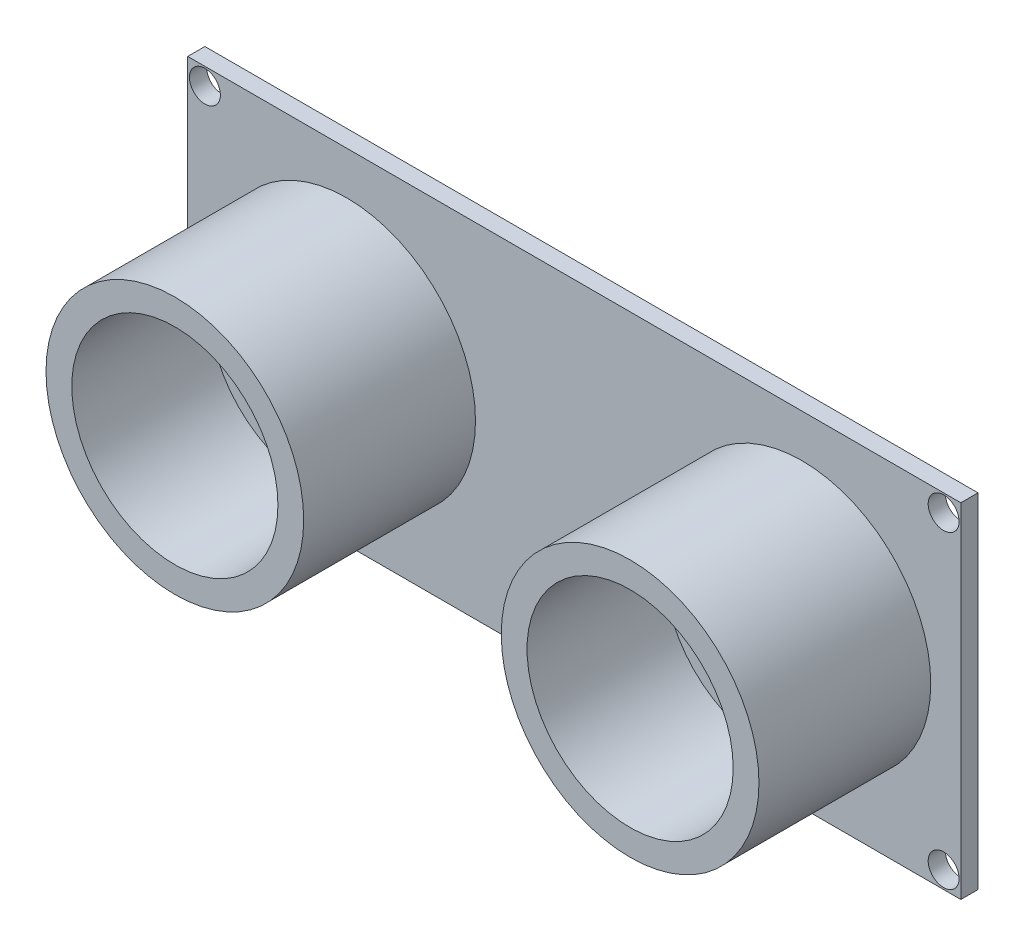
ISO-10303-21;
HEADER;
FILE_DESCRIPTION(('STEP AP214'),'2;1');
FILE_NAME('part.step','',(''),(''),'','','');
FILE_SCHEMA(('AUTOMOTIVE_DESIGN { 1 0 10303 214 1 1 1 1 }'));
ENDSEC;
DATA;
#1=APPLICATION_CONTEXT('core data for automotive mechanical design processes');
#2=APPLICATION_PROTOCOL_DEFINITION('international standard','automotive_design',2000,#1);
#3=PRODUCT_CONTEXT('',#1,'mechanical');
#4=PRODUCT('Part','Part','',(#3));
#5=PRODUCT_RELATED_PRODUCT_CATEGORY('part','',(#4));
#6=PRODUCT_DEFINITION_FORMATION('','',#4);
#7=PRODUCT_DEFINITION_CONTEXT('part definition',#1,'design');
#8=PRODUCT_DEFINITION('design','',#6,#7);
#9=PRODUCT_DEFINITION_SHAPE('','',#8);
#10=(LENGTH_UNIT() NAMED_UNIT(*) SI_UNIT(.MILLI.,.METRE.));
#11=(NAMED_UNIT(*) PLANE_ANGLE_UNIT() SI_UNIT($,.RADIAN.));
#12=(NAMED_UNIT(*) SI_UNIT($,.STERADIAN.) SOLID_ANGLE_UNIT());
#13=UNCERTAINTY_MEASURE_WITH_UNIT(LENGTH_MEASURE(1.E-05),#10,'distance_accuracy_value','');
#14=(GEOMETRIC_REPRESENTATION_CONTEXT(3) GLOBAL_UNCERTAINTY_ASSIGNED_CONTEXT((#13)) GLOBAL_UNIT_ASSIGNED_CONTEXT((#10,
#11,#12)) REPRESENTATION_CONTEXT('',''));
#15=CARTESIAN_POINT('',(0.,0.,0.));
#16=DIRECTION('',(0.,0.,1.));
#17=DIRECTION('',(1.,0.,0.));
#18=AXIS2_PLACEMENT_3D('',#15,#16,#17);
#19=CARTESIAN_POINT('',(0.,0.,0.));
#20=DIRECTION('',(0.,0.,1.));
#21=DIRECTION('',(1.,0.,0.));
#22=AXIS2_PLACEMENT_3D('',#19,#20,#21);
#23=PLANE('',#22);
#24=CARTESIAN_POINT('',(-21.5,9.,0.));
#25=DIRECTION('',(0.,0.,1.));
#26=DIRECTION('',(1.,0.,0.));
#27=AXIS2_PLACEMENT_3D('',#24,#25,#26);
#28=CIRCLE('',#27,0.899999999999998);
#29=CARTESIAN_POINT('',(-20.6,9.,0.));
#30=VERTEX_POINT('',#29);
#31=EDGE_CURVE('E362',#30,#30,#28,.T.);
#32=ORIENTED_EDGE('',*,*,#31,.T.);
#33=EDGE_LOOP('',(#32));
#34=FACE_BOUND('',#33,.T.);
#35=CARTESIAN_POINT('',(21.5,9.,0.));
#36=DIRECTION('',(0.,0.,1.));
#37=DIRECTION('',(1.,0.,0.));
#38=AXIS2_PLACEMENT_3D('',#35,#36,#37);
#39=CIRCLE('',#38,0.899999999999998);
#40=CARTESIAN_POINT('',(22.4,9.,0.));
#41=VERTEX_POINT('',#40);
#42=EDGE_CURVE('E368',#41,#41,#39,.T.);
#43=ORIENTED_EDGE('',*,*,#42,.T.);
#44=EDGE_LOOP('',(#43));
#45=FACE_BOUND('',#44,.T.);
#46=CARTESIAN_POINT('',(-21.5,-9.,0.));
#47=DIRECTION('',(0.,0.,1.));
#48=DIRECTION('',(1.,0.,0.));
#49=AXIS2_PLACEMENT_3D('',#46,#47,#48);
#50=CIRCLE('',#49,0.899999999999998);
#51=CARTESIAN_POINT('',(-20.6,-9.,0.));
#52=VERTEX_POINT('',#51);
#53=EDGE_CURVE('E374',#52,#52,#50,.T.);
#54=ORIENTED_EDGE('',*,*,#53,.T.);
#55=EDGE_LOOP('',(#54));
#56=FACE_BOUND('',#55,.T.);
#57=CARTESIAN_POINT('',(21.5,-9.,0.));
#58=DIRECTION('',(0.,0.,1.));
#59=DIRECTION('',(1.,0.,0.));
#60=AXIS2_PLACEMENT_3D('',#57,#58,#59);
#61=CIRCLE('',#60,0.899999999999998);
#62=CARTESIAN_POINT('',(22.4,-9.,0.));
#63=VERTEX_POINT('',#62);
#64=EDGE_CURVE('E380',#63,#63,#61,.T.);
#65=ORIENTED_EDGE('',*,*,#64,.T.);
#66=EDGE_LOOP('',(#65));
#67=FACE_BOUND('',#66,.T.);
#68=DIRECTION('',(0.,1.,0.));
#69=VECTOR('',#68,1.);
#70=CARTESIAN_POINT('',(-2.5,-8.,0.));
#71=LINE('',#70,#69);
#72=CARTESIAN_POINT('',(-2.5,-10.,0.));
#73=VERTEX_POINT('',#72);
#74=CARTESIAN_POINT('',(-2.5,-8.,0.));
#75=VERTEX_POINT('',#74);
#76=EDGE_CURVE('E231',#73,#75,#71,.T.);
#77=ORIENTED_EDGE('',*,*,#76,.F.);
#78=DIRECTION('',(1.,0.,0.));
#79=VECTOR('',#78,1.);
#80=CARTESIAN_POINT('',(-22.5,-10.,0.));
#81=LINE('',#80,#79);
#82=CARTESIAN_POINT('',(-22.5,-10.,0.));
#83=VERTEX_POINT('',#82);
#84=EDGE_CURVE('E388',#83,#73,#81,.T.);
#85=ORIENTED_EDGE('',*,*,#84,.F.);
#86=DIRECTION('',(0.,-1.,0.));
#87=VECTOR('',#86,1.);
#88=CARTESIAN_POINT('',(-22.5,10.,0.));
#89=LINE('',#88,#87);
#90=CARTESIAN_POINT('',(-22.5,10.,0.));
#91=VERTEX_POINT('',#90);
#92=EDGE_CURVE('E399',#91,#83,#89,.T.);
#93=ORIENTED_EDGE('',*,*,#92,.F.);
#94=DIRECTION('',(-1.,0.,0.));
#95=VECTOR('',#94,1.);
#96=CARTESIAN_POINT('',(-22.5,10.,0.));
#97=LINE('',#96,#95);
#98=CARTESIAN_POINT('',(22.5,10.,0.));
#99=VERTEX_POINT('',#98);
#100=EDGE_CURVE('E397',#99,#91,#97,.T.);
#101=ORIENTED_EDGE('',*,*,#100,.F.);
#102=DIRECTION('',(0.,1.,0.));
#103=VECTOR('',#102,1.);
#104=CARTESIAN_POINT('',(22.5,10.,0.));
#105=LINE('',#104,#103);
#106=CARTESIAN_POINT('',(22.5,-10.,0.));
#107=VERTEX_POINT('',#106);
#108=EDGE_CURVE('E383',#107,#99,#105,.T.);
#109=ORIENTED_EDGE('',*,*,#108,.F.);
#110=CARTESIAN_POINT('',(2.49999999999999,-10.,0.));
#111=VERTEX_POINT('',#110);
#112=EDGE_CURVE('E401',#111,#107,#81,.T.);
#113=ORIENTED_EDGE('',*,*,#112,.F.);
#114=DIRECTION('',(0.,-1.,0.));
#115=VECTOR('',#114,1.);
#116=CARTESIAN_POINT('',(2.5,-8.,0.));
#117=LINE('',#116,#115);
#118=CARTESIAN_POINT('',(2.5,-8.,0.));
#119=VERTEX_POINT('',#118);
#120=EDGE_CURVE('E316',#119,#111,#117,.T.);
#121=ORIENTED_EDGE('',*,*,#120,.F.);
#122=DIRECTION('',(1.,0.,0.));
#123=VECTOR('',#122,1.);
#124=CARTESIAN_POINT('',(2.5,-8.,0.));
#125=LINE('',#124,#123);
#126=CARTESIAN_POINT('',(2.,-8.,0.));
#127=VERTEX_POINT('',#126);
#128=EDGE_CURVE('E309',#127,#119,#125,.T.);
#129=ORIENTED_EDGE('',*,*,#128,.F.);
#130=DIRECTION('',(0.,1.,0.));
#131=VECTOR('',#130,1.);
#132=CARTESIAN_POINT('',(2.,-8.,0.));
#133=LINE('',#132,#131);
#134=CARTESIAN_POINT('',(1.99999999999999,-10.,0.));
#135=VERTEX_POINT('',#134);
#136=EDGE_CURVE('E11',#135,#127,#133,.T.);
#137=ORIENTED_EDGE('',*,*,#136,.F.);
#138=CARTESIAN_POINT('',(0.999999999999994,-10.,0.));
#139=VERTEX_POINT('',#138);
#140=EDGE_CURVE('E945',#139,#135,#81,.T.);
#141=ORIENTED_EDGE('',*,*,#140,.F.);
#142=DIRECTION('',(0.,-1.,0.));
#143=VECTOR('',#142,1.);
#144=CARTESIAN_POINT('',(1.,-8.,0.));
#145=LINE('',#144,#143);
#146=CARTESIAN_POINT('',(1.,-8.,0.));
#147=VERTEX_POINT('',#146);
#148=EDGE_CURVE('E291',#147,#139,#145,.T.);
#149=ORIENTED_EDGE('',*,*,#148,.F.);
#150=DIRECTION('',(1.,0.,0.));
#151=VECTOR('',#150,1.);
#152=CARTESIAN_POINT('',(1.,-8.,0.));
#153=LINE('',#152,#151);
#154=CARTESIAN_POINT('',(0.500000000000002,-8.,0.));
#155=VERTEX_POINT('',#154);
#156=EDGE_CURVE('E293',#155,#147,#153,.T.);
#157=ORIENTED_EDGE('',*,*,#156,.F.);
#158=DIRECTION('',(0.,1.,0.));
#159=VECTOR('',#158,1.);
#160=CARTESIAN_POINT('',(0.500000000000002,-8.,0.));
#161=LINE('',#160,#159);
#162=CARTESIAN_POINT('',(0.500000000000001,-10.,0.));
#163=VERTEX_POINT('',#162);
#164=EDGE_CURVE('E288',#163,#155,#161,.T.);
#165=ORIENTED_EDGE('',*,*,#164,.F.);
#166=CARTESIAN_POINT('',(-0.500000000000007,-10.,0.));
#167=VERTEX_POINT('',#166);
#168=EDGE_CURVE('E940',#167,#163,#81,.T.);
#169=ORIENTED_EDGE('',*,*,#168,.F.);
#170=DIRECTION('',(0.,-1.,0.));
#171=VECTOR('',#170,1.);
#172=CARTESIAN_POINT('',(-0.500000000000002,-8.,0.));
#173=LINE('',#172,#171);
#174=CARTESIAN_POINT('',(-0.500000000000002,-8.,0.));
#175=VERTEX_POINT('',#174);
#176=EDGE_CURVE('E64',#175,#167,#173,.T.);
#177=ORIENTED_EDGE('',*,*,#176,.F.);
#178=DIRECTION('',(1.,0.,0.));
#179=VECTOR('',#178,1.);
#180=CARTESIAN_POINT('',(-1.,-8.,0.));
#181=LINE('',#180,#179);
#182=CARTESIAN_POINT('',(-1.,-8.,0.));
#183=VERTEX_POINT('',#182);
#184=EDGE_CURVE('E259',#183,#175,#181,.T.);
#185=ORIENTED_EDGE('',*,*,#184,.F.);
#186=DIRECTION('',(0.,1.,0.));
#187=VECTOR('',#186,1.);
#188=CARTESIAN_POINT('',(-1.,-8.,0.));
#189=LINE('',#188,#187);
#190=CARTESIAN_POINT('',(-1.,-10.,0.));
#191=VERTEX_POINT('',#190);
#192=EDGE_CURVE('E261',#191,#183,#189,.T.);
#193=ORIENTED_EDGE('',*,*,#192,.F.);
#194=CARTESIAN_POINT('',(-2.00000000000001,-10.,0.));
#195=VERTEX_POINT('',#194);
#196=EDGE_CURVE('E404',#195,#191,#81,.T.);
#197=ORIENTED_EDGE('',*,*,#196,.F.);
#198=DIRECTION('',(0.,-1.,0.));
#199=VECTOR('',#198,1.);
#200=CARTESIAN_POINT('',(-2.,-8.,0.));
#201=LINE('',#200,#199);
#202=CARTESIAN_POINT('',(-2.,-8.,0.));
#203=VERTEX_POINT('',#202);
#204=EDGE_CURVE('E56',#203,#195,#201,.T.);
#205=ORIENTED_EDGE('',*,*,#204,.F.);
#206=DIRECTION('',(1.,0.,0.));
#207=VECTOR('',#206,1.);
#208=CARTESIAN_POINT('',(-2.5,-8.,0.));
#209=LINE('',#208,#207);
#210=EDGE_CURVE('E236',#75,#203,#209,.T.);
#211=ORIENTED_EDGE('',*,*,#210,.F.);
#212=EDGE_LOOP('',(#77,#85,#93,#101,#109,#113,#121,#129,#137,#141,#149,#157,#165,#169,#177,#185,
#193,#197,#205,#211));
#213=FACE_BOUND('',#212,.T.);
#214=ADVANCED_FACE('F39',(#34,#45,#56,#67,#213),#23,.F.);
#215=CARTESIAN_POINT('',(22.5,10.,1.));
#216=DIRECTION('',(-1.,0.,0.));
#217=DIRECTION('',(0.,-1.,0.));
#218=AXIS2_PLACEMENT_3D('',#215,#216,#217);
#219=PLANE('',#218);
#220=ORIENTED_EDGE('',*,*,#108,.T.);
#221=DIRECTION('',(0.,0.,-1.));
#222=VECTOR('',#221,1.);
#223=CARTESIAN_POINT('',(22.5,10.,1.));
#224=LINE('',#223,#222);
#225=CARTESIAN_POINT('',(22.5,10.,1.));
#226=VERTEX_POINT('',#225);
#227=EDGE_CURVE('E43',#226,#99,#224,.T.);
#228=ORIENTED_EDGE('',*,*,#227,.F.);
#229=DIRECTION('',(0.,1.,0.));
#230=VECTOR('',#229,1.);
#231=CARTESIAN_POINT('',(22.5,10.,1.));
#232=LINE('',#231,#230);
#233=CARTESIAN_POINT('',(22.5,-10.,1.));
#234=VERTEX_POINT('',#233);
#235=EDGE_CURVE('E384',#234,#226,#232,.T.);
#236=ORIENTED_EDGE('',*,*,#235,.F.);
#237=DIRECTION('',(0.,0.,-1.));
#238=VECTOR('',#237,1.);
#239=CARTESIAN_POINT('',(22.5,-10.,1.));
#240=LINE('',#239,#238);
#241=EDGE_CURVE('E394',#234,#107,#240,.T.);
#242=ORIENTED_EDGE('',*,*,#241,.T.);
#243=EDGE_LOOP('',(#220,#228,#236,#242));
#244=FACE_BOUND('',#243,.T.);
#245=ADVANCED_FACE('F41',(#244),#219,.F.);
#246=CARTESIAN_POINT('',(-22.5,10.,1.));
#247=DIRECTION('',(0.,-1.,0.));
#248=DIRECTION('',(0.,0.,-1.));
#249=AXIS2_PLACEMENT_3D('',#246,#247,#248);
#250=PLANE('',#249);
#251=ORIENTED_EDGE('',*,*,#100,.T.);
#252=DIRECTION('',(0.,0.,-1.));
#253=VECTOR('',#252,1.);
#254=CARTESIAN_POINT('',(-22.5,10.,1.));
#255=LINE('',#254,#253);
#256=CARTESIAN_POINT('',(-22.5,10.,1.));
#257=VERTEX_POINT('',#256);
#258=EDGE_CURVE('E410',#257,#91,#255,.T.);
#259=ORIENTED_EDGE('',*,*,#258,.F.);
#260=DIRECTION('',(-1.,0.,0.));
#261=VECTOR('',#260,1.);
#262=CARTESIAN_POINT('',(-22.5,10.,1.));
#263=LINE('',#262,#261);
#264=EDGE_CURVE('E387',#226,#257,#263,.T.);
#265=ORIENTED_EDGE('',*,*,#264,.F.);
#266=ORIENTED_EDGE('',*,*,#227,.T.);
#267=EDGE_LOOP('',(#251,#259,#265,#266));
#268=FACE_BOUND('',#267,.T.);
#269=ADVANCED_FACE('F419',(#268),#250,.F.);
#270=CARTESIAN_POINT('',(-22.5,10.,1.));
#271=DIRECTION('',(1.,0.,0.));
#272=DIRECTION('',(0.,0.,-1.));
#273=AXIS2_PLACEMENT_3D('',#270,#271,#272);
#274=PLANE('',#273);
#275=ORIENTED_EDGE('',*,*,#92,.T.);
#276=DIRECTION('',(0.,0.,-1.));
#277=VECTOR('',#276,1.);
#278=CARTESIAN_POINT('',(-22.5,-10.,1.));
#279=LINE('',#278,#277);
#280=CARTESIAN_POINT('',(-22.5,-10.,1.));
#281=VERTEX_POINT('',#280);
#282=EDGE_CURVE('E408',#281,#83,#279,.T.);
#283=ORIENTED_EDGE('',*,*,#282,.F.);
#284=DIRECTION('',(0.,-1.,0.));
#285=VECTOR('',#284,1.);
#286=CARTESIAN_POINT('',(-22.5,10.,1.));
#287=LINE('',#286,#285);
#288=EDGE_CURVE('E390',#257,#281,#287,.T.);
#289=ORIENTED_EDGE('',*,*,#288,.F.);
#290=ORIENTED_EDGE('',*,*,#258,.T.);
#291=EDGE_LOOP('',(#275,#283,#289,#290));
#292=FACE_BOUND('',#291,.T.);
#293=ADVANCED_FACE('F428',(#292),#274,.F.);
#294=CARTESIAN_POINT('',(-22.5,-10.,1.));
#295=DIRECTION('',(0.,1.,0.));
#296=DIRECTION('',(0.,0.,1.));
#297=AXIS2_PLACEMENT_3D('',#294,#295,#296);
#298=PLANE('',#297);
#299=ORIENTED_EDGE('',*,*,#84,.T.);
#300=EDGE_CURVE('E229',#73,#195,#81,.T.);
#301=ORIENTED_EDGE('',*,*,#300,.T.);
#302=ORIENTED_EDGE('',*,*,#196,.T.);
#303=EDGE_CURVE('E939',#191,#167,#81,.T.);
#304=ORIENTED_EDGE('',*,*,#303,.T.);
#305=ORIENTED_EDGE('',*,*,#168,.T.);
#306=EDGE_CURVE('E941',#163,#139,#81,.T.);
#307=ORIENTED_EDGE('',*,*,#306,.T.);
#308=ORIENTED_EDGE('',*,*,#140,.T.);
#309=EDGE_CURVE('E405',#135,#111,#81,.T.);
#310=ORIENTED_EDGE('',*,*,#309,.T.);
#311=ORIENTED_EDGE('',*,*,#112,.T.);
#312=ORIENTED_EDGE('',*,*,#241,.F.);
#313=DIRECTION('',(1.,0.,0.));
#314=VECTOR('',#313,1.);
#315=CARTESIAN_POINT('',(-22.5,-10.,1.));
#316=LINE('',#315,#314);
#317=EDGE_CURVE('E392',#281,#234,#316,.T.);
#318=ORIENTED_EDGE('',*,*,#317,.F.);
#319=ORIENTED_EDGE('',*,*,#282,.T.);
#320=EDGE_LOOP('',(#299,#301,#302,#304,#305,#307,#308,#310,#311,#312,#318,#319));
#321=FACE_BOUND('',#320,.T.);
#322=ADVANCED_FACE('F431',(#321),#298,.F.);
#323=CARTESIAN_POINT('',(0.,0.,1.));
#324=DIRECTION('',(0.,0.,1.));
#325=DIRECTION('',(1.,0.,0.));
#326=AXIS2_PLACEMENT_3D('',#323,#324,#325);
#327=PLANE('',#326);
#328=CARTESIAN_POINT('',(13.25,0.,1.));
#329=DIRECTION('',(0.,0.,1.));
#330=DIRECTION('',(1.,0.,0.));
#331=AXIS2_PLACEMENT_3D('',#328,#329,#330);
#332=CIRCLE('',#331,7.5);
#333=CARTESIAN_POINT('',(20.75,0.,1.));
#334=VERTEX_POINT('',#333);
#335=EDGE_CURVE('E348',#334,#334,#332,.T.);
#336=ORIENTED_EDGE('',*,*,#335,.F.);
#337=EDGE_LOOP('',(#336));
#338=FACE_BOUND('',#337,.T.);
#339=CARTESIAN_POINT('',(-13.25,0.,1.));
#340=DIRECTION('',(0.,0.,1.));
#341=DIRECTION('',(1.,0.,0.));
#342=AXIS2_PLACEMENT_3D('',#339,#340,#341);
#343=CIRCLE('',#342,7.5);
#344=CARTESIAN_POINT('',(-5.75,0.,1.));
#345=VERTEX_POINT('',#344);
#346=EDGE_CURVE('E351',#345,#345,#343,.T.);
#347=ORIENTED_EDGE('',*,*,#346,.F.);
#348=EDGE_LOOP('',(#347));
#349=FACE_BOUND('',#348,.T.);
#350=CARTESIAN_POINT('',(-21.5,9.,1.));
#351=DIRECTION('',(0.,0.,1.));
#352=DIRECTION('',(1.,0.,0.));
#353=AXIS2_PLACEMENT_3D('',#350,#351,#352);
#354=CIRCLE('',#353,0.900000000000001);
#355=CARTESIAN_POINT('',(-20.6,9.,1.));
#356=VERTEX_POINT('',#355);
#357=EDGE_CURVE('E357',#356,#356,#354,.T.);
#358=ORIENTED_EDGE('',*,*,#357,.F.);
#359=EDGE_LOOP('',(#358));
#360=FACE_BOUND('',#359,.T.);
#361=CARTESIAN_POINT('',(21.5,9.,1.));
#362=DIRECTION('',(0.,0.,1.));
#363=DIRECTION('',(1.,0.,0.));
#364=AXIS2_PLACEMENT_3D('',#361,#362,#363);
#365=CIRCLE('',#364,0.900000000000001);
#366=CARTESIAN_POINT('',(22.4,9.,1.));
#367=VERTEX_POINT('',#366);
#368=EDGE_CURVE('E365',#367,#367,#365,.T.);
#369=ORIENTED_EDGE('',*,*,#368,.F.);
#370=EDGE_LOOP('',(#369));
#371=FACE_BOUND('',#370,.T.);
#372=CARTESIAN_POINT('',(-21.5,-9.,1.));
#373=DIRECTION('',(0.,0.,1.));
#374=DIRECTION('',(1.,0.,0.));
#375=AXIS2_PLACEMENT_3D('',#372,#373,#374);
#376=CIRCLE('',#375,0.900000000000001);
#377=CARTESIAN_POINT('',(-20.6,-9.,1.));
#378=VERTEX_POINT('',#377);
#379=EDGE_CURVE('E371',#378,#378,#376,.T.);
#380=ORIENTED_EDGE('',*,*,#379,.F.);
#381=EDGE_LOOP('',(#380));
#382=FACE_BOUND('',#381,.T.);
#383=CARTESIAN_POINT('',(21.5,-9.,1.));
#384=DIRECTION('',(0.,0.,1.));
#385=DIRECTION('',(1.,0.,0.));
#386=AXIS2_PLACEMENT_3D('',#383,#384,#385);
#387=CIRCLE('',#386,0.900000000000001);
#388=CARTESIAN_POINT('',(22.4,-9.,1.));
#389=VERTEX_POINT('',#388);
#390=EDGE_CURVE('E377',#389,#389,#387,.T.);
#391=ORIENTED_EDGE('',*,*,#390,.F.);
#392=EDGE_LOOP('',(#391));
#393=FACE_BOUND('',#392,.T.);
#394=ORIENTED_EDGE('',*,*,#235,.T.);
#395=ORIENTED_EDGE('',*,*,#264,.T.);
#396=ORIENTED_EDGE('',*,*,#288,.T.);
#397=ORIENTED_EDGE('',*,*,#317,.T.);
#398=EDGE_LOOP('',(#394,#395,#396,#397));
#399=FACE_BOUND('',#398,.T.);
#400=ADVANCED_FACE('F433',(#338,#349,#360,#371,#382,#393,#399),#327,.T.);
#401=CARTESIAN_POINT('',(21.5,-9.,1.));
#402=DIRECTION('',(0.,0.,1.));
#403=DIRECTION('',(1.,0.,0.));
#404=AXIS2_PLACEMENT_3D('',#401,#402,#403);
#405=CYLINDRICAL_SURFACE('',#404,0.9);
#406=ORIENTED_EDGE('',*,*,#64,.F.);
#407=EDGE_LOOP('',(#406));
#408=FACE_BOUND('',#407,.T.);
#409=ORIENTED_EDGE('',*,*,#390,.T.);
#410=EDGE_LOOP('',(#409));
#411=FACE_BOUND('',#410,.T.);
#412=ADVANCED_FACE('F435',(#408,#411),#405,.F.);
#413=CARTESIAN_POINT('',(-21.5,-9.,1.));
#414=DIRECTION('',(0.,0.,1.));
#415=DIRECTION('',(1.,0.,0.));
#416=AXIS2_PLACEMENT_3D('',#413,#414,#415);
#417=CYLINDRICAL_SURFACE('',#416,0.9);
#418=ORIENTED_EDGE('',*,*,#53,.F.);
#419=EDGE_LOOP('',(#418));
#420=FACE_BOUND('',#419,.T.);
#421=ORIENTED_EDGE('',*,*,#379,.T.);
#422=EDGE_LOOP('',(#421));
#423=FACE_BOUND('',#422,.T.);
#424=ADVANCED_FACE('F443',(#420,#423),#417,.F.);
#425=CARTESIAN_POINT('',(21.5,9.,1.));
#426=DIRECTION('',(0.,0.,1.));
#427=DIRECTION('',(1.,0.,0.));
#428=AXIS2_PLACEMENT_3D('',#425,#426,#427);
#429=CYLINDRICAL_SURFACE('',#428,0.9);
#430=ORIENTED_EDGE('',*,*,#42,.F.);
#431=EDGE_LOOP('',(#430));
#432=FACE_BOUND('',#431,.T.);
#433=ORIENTED_EDGE('',*,*,#368,.T.);
#434=EDGE_LOOP('',(#433));
#435=FACE_BOUND('',#434,.T.);
#436=ADVANCED_FACE('F499',(#432,#435),#429,.F.);
#437=CARTESIAN_POINT('',(-21.5,9.,1.));
#438=DIRECTION('',(0.,0.,1.));
#439=DIRECTION('',(1.,0.,0.));
#440=AXIS2_PLACEMENT_3D('',#437,#438,#439);
#441=CYLINDRICAL_SURFACE('',#440,0.9);
#442=ORIENTED_EDGE('',*,*,#31,.F.);
#443=EDGE_LOOP('',(#442));
#444=FACE_BOUND('',#443,.T.);
#445=ORIENTED_EDGE('',*,*,#357,.T.);
#446=EDGE_LOOP('',(#445));
#447=FACE_BOUND('',#446,.T.);
#448=ADVANCED_FACE('F507',(#444,#447),#441,.F.);
#449=CARTESIAN_POINT('',(-13.25,0.,11.));
#450=DIRECTION('',(0.,0.,-1.));
#451=DIRECTION('',(-1.,0.,0.));
#452=AXIS2_PLACEMENT_3D('',#449,#450,#451);
#453=CYLINDRICAL_SURFACE('',#452,7.5);
#454=CARTESIAN_POINT('',(-13.25,0.,11.));
#455=DIRECTION('',(0.,0.,1.));
#456=DIRECTION('',(1.,0.,0.));
#457=AXIS2_PLACEMENT_3D('',#454,#455,#456);
#458=CIRCLE('',#457,7.5);
#459=CARTESIAN_POINT('',(-5.75,0.,11.));
#460=VERTEX_POINT('',#459);
#461=EDGE_CURVE('E354',#460,#460,#458,.T.);
#462=ORIENTED_EDGE('',*,*,#461,.F.);
#463=EDGE_LOOP('',(#462));
#464=FACE_BOUND('',#463,.T.);
#465=ORIENTED_EDGE('',*,*,#346,.T.);
#466=EDGE_LOOP('',(#465));
#467=FACE_BOUND('',#466,.T.);
#468=ADVANCED_FACE('F514',(#464,#467),#453,.T.);
#469=CARTESIAN_POINT('',(-13.25,0.,11.));
#470=DIRECTION('',(0.,0.,1.));
#471=DIRECTION('',(1.,0.,0.));
#472=AXIS2_PLACEMENT_3D('',#469,#470,#471);
#473=PLANE('',#472);
#474=CARTESIAN_POINT('',(-13.25,0.,11.));
#475=DIRECTION('',(0.,0.,1.));
#476=DIRECTION('',(1.,0.,0.));
#477=AXIS2_PLACEMENT_3D('',#474,#475,#476);
#478=CIRCLE('',#477,6.);
#479=CARTESIAN_POINT('',(-7.25,0.,11.));
#480=VERTEX_POINT('',#479);
#481=EDGE_CURVE('E340',#480,#480,#478,.T.);
#482=ORIENTED_EDGE('',*,*,#481,.F.);
#483=EDGE_LOOP('',(#482));
#484=FACE_BOUND('',#483,.T.);
#485=ORIENTED_EDGE('',*,*,#461,.T.);
#486=EDGE_LOOP('',(#485));
#487=FACE_BOUND('',#486,.T.);
#488=ADVANCED_FACE('F522',(#484,#487),#473,.T.);
#489=CARTESIAN_POINT('',(13.25,0.,11.));
#490=DIRECTION('',(0.,0.,-1.));
#491=DIRECTION('',(-1.,0.,0.));
#492=AXIS2_PLACEMENT_3D('',#489,#490,#491);
#493=CYLINDRICAL_SURFACE('',#492,7.5);
#494=CARTESIAN_POINT('',(13.25,0.,11.));
#495=DIRECTION('',(0.,0.,1.));
#496=DIRECTION('',(1.,0.,0.));
#497=AXIS2_PLACEMENT_3D('',#494,#495,#496);
#498=CIRCLE('',#497,7.5);
#499=CARTESIAN_POINT('',(20.75,0.,11.));
#500=VERTEX_POINT('',#499);
#501=EDGE_CURVE('E339',#500,#500,#498,.T.);
#502=ORIENTED_EDGE('',*,*,#501,.F.);
#503=EDGE_LOOP('',(#502));
#504=FACE_BOUND('',#503,.T.);
#505=ORIENTED_EDGE('',*,*,#335,.T.);
#506=EDGE_LOOP('',(#505));
#507=FACE_BOUND('',#506,.T.);
#508=ADVANCED_FACE('F530',(#504,#507),#493,.T.);
#509=CARTESIAN_POINT('',(13.25,0.,11.));
#510=DIRECTION('',(0.,0.,1.));
#511=DIRECTION('',(1.,0.,0.));
#512=AXIS2_PLACEMENT_3D('',#509,#510,#511);
#513=PLANE('',#512);
#514=CARTESIAN_POINT('',(13.25,0.,11.));
#515=DIRECTION('',(0.,0.,1.));
#516=DIRECTION('',(1.,0.,0.));
#517=AXIS2_PLACEMENT_3D('',#514,#515,#516);
#518=CIRCLE('',#517,6.);
#519=CARTESIAN_POINT('',(19.25,0.,11.));
#520=VERTEX_POINT('',#519);
#521=EDGE_CURVE('E343',#520,#520,#518,.T.);
#522=ORIENTED_EDGE('',*,*,#521,.F.);
#523=EDGE_LOOP('',(#522));
#524=FACE_BOUND('',#523,.T.);
#525=ORIENTED_EDGE('',*,*,#501,.T.);
#526=EDGE_LOOP('',(#525));
#527=FACE_BOUND('',#526,.T.);
#528=ADVANCED_FACE('F539',(#524,#527),#513,.T.);
#529=CARTESIAN_POINT('',(13.25,0.,3.));
#530=DIRECTION('',(0.,0.,1.));
#531=DIRECTION('',(1.,0.,0.));
#532=AXIS2_PLACEMENT_3D('',#529,#530,#531);
#533=CYLINDRICAL_SURFACE('',#532,6.);
#534=CARTESIAN_POINT('',(13.25,0.,3.));
#535=DIRECTION('',(0.,0.,1.));
#536=DIRECTION('',(1.,0.,0.));
#537=AXIS2_PLACEMENT_3D('',#534,#535,#536);
#538=CIRCLE('',#537,6.);
#539=CARTESIAN_POINT('',(19.25,0.,3.));
#540=VERTEX_POINT('',#539);
#541=EDGE_CURVE('E335',#540,#540,#538,.T.);
#542=ORIENTED_EDGE('',*,*,#541,.F.);
#543=EDGE_LOOP('',(#542));
#544=FACE_BOUND('',#543,.T.);
#545=ORIENTED_EDGE('',*,*,#521,.T.);
#546=EDGE_LOOP('',(#545));
#547=FACE_BOUND('',#546,.T.);
#548=ADVANCED_FACE('F545',(#544,#547),#533,.F.);
#549=CARTESIAN_POINT('',(13.25,0.,3.));
#550=DIRECTION('',(0.,0.,1.));
#551=DIRECTION('',(1.,0.,0.));
#552=AXIS2_PLACEMENT_3D('',#549,#550,#551);
#553=PLANE('',#552);
#554=ORIENTED_EDGE('',*,*,#541,.T.);
#555=EDGE_LOOP('',(#554));
#556=FACE_BOUND('',#555,.T.);
#557=ADVANCED_FACE('F553',(#556),#553,.T.);
#558=CARTESIAN_POINT('',(-13.25,0.,3.));
#559=DIRECTION('',(0.,0.,1.));
#560=DIRECTION('',(1.,0.,0.));
#561=AXIS2_PLACEMENT_3D('',#558,#559,#560);
#562=CYLINDRICAL_SURFACE('',#561,6.);
#563=CARTESIAN_POINT('',(-13.25,0.,3.));
#564=DIRECTION('',(0.,0.,1.));
#565=DIRECTION('',(1.,0.,0.));
#566=AXIS2_PLACEMENT_3D('',#563,#564,#565);
#567=CIRCLE('',#566,6.);
#568=CARTESIAN_POINT('',(-7.25,0.,3.));
#569=VERTEX_POINT('',#568);
#570=EDGE_CURVE('E336',#569,#569,#567,.T.);
#571=ORIENTED_EDGE('',*,*,#570,.F.);
#572=EDGE_LOOP('',(#571));
#573=FACE_BOUND('',#572,.T.);
#574=ORIENTED_EDGE('',*,*,#481,.T.);
#575=EDGE_LOOP('',(#574));
#576=FACE_BOUND('',#575,.T.);
#577=ADVANCED_FACE('F561',(#573,#576),#562,.F.);
#578=CARTESIAN_POINT('',(-13.25,0.,3.));
#579=DIRECTION('',(0.,0.,1.));
#580=DIRECTION('',(1.,0.,0.));
#581=AXIS2_PLACEMENT_3D('',#578,#579,#580);
#582=PLANE('',#581);
#583=ORIENTED_EDGE('',*,*,#570,.T.);
#584=EDGE_LOOP('',(#583));
#585=FACE_BOUND('',#584,.T.);
#586=ADVANCED_FACE('F569',(#585),#582,.T.);
#587=CARTESIAN_POINT('',(2.5,-8.,-0.5));
#588=DIRECTION('',(-1.,0.,0.));
#589=DIRECTION('',(0.,-1.,0.));
#590=AXIS2_PLACEMENT_3D('',#587,#588,#589);
#591=PLANE('',#590);
#592=ORIENTED_EDGE('',*,*,#120,.T.);
#593=CARTESIAN_POINT('',(2.5,-15.,0.));
#594=VERTEX_POINT('',#593);
#595=EDGE_CURVE('E296',#111,#594,#117,.T.);
#596=ORIENTED_EDGE('',*,*,#595,.T.);
#597=DIRECTION('',(0.,0.,1.));
#598=VECTOR('',#597,1.);
#599=CARTESIAN_POINT('',(2.5,-15.,-0.5));
#600=LINE('',#599,#598);
#601=CARTESIAN_POINT('',(2.5,-15.,-0.5));
#602=VERTEX_POINT('',#601);
#603=EDGE_CURVE('E332',#602,#594,#600,.T.);
#604=ORIENTED_EDGE('',*,*,#603,.F.);
#605=DIRECTION('',(0.,-1.,0.));
#606=VECTOR('',#605,1.);
#607=CARTESIAN_POINT('',(2.5,-8.,-0.5));
#608=LINE('',#607,#606);
#609=CARTESIAN_POINT('',(2.5,-8.,-0.5));
#610=VERTEX_POINT('',#609);
#611=EDGE_CURVE('E305',#610,#602,#608,.T.);
#612=ORIENTED_EDGE('',*,*,#611,.F.);
#613=DIRECTION('',(0.,0.,1.));
#614=VECTOR('',#613,1.);
#615=CARTESIAN_POINT('',(2.5,-8.,-0.5));
#616=LINE('',#615,#614);
#617=EDGE_CURVE('E315',#610,#119,#616,.T.);
#618=ORIENTED_EDGE('',*,*,#617,.T.);
#619=EDGE_LOOP('',(#592,#596,#604,#612,#618));
#620=FACE_BOUND('',#619,.T.);
#621=ADVANCED_FACE('F576',(#620),#591,.F.);
#622=CARTESIAN_POINT('',(2.5,-15.,-0.5));
#623=DIRECTION('',(0.,1.,0.));
#624=DIRECTION('',(0.,0.,1.));
#625=AXIS2_PLACEMENT_3D('',#622,#623,#624);
#626=PLANE('',#625);
#627=DIRECTION('',(-1.,0.,0.));
#628=VECTOR('',#627,1.);
#629=CARTESIAN_POINT('',(2.5,-15.,0.));
#630=LINE('',#629,#628);
#631=CARTESIAN_POINT('',(2.,-15.,0.));
#632=VERTEX_POINT('',#631);
#633=EDGE_CURVE('E319',#594,#632,#630,.T.);
#634=ORIENTED_EDGE('',*,*,#633,.T.);
#635=DIRECTION('',(0.,0.,1.));
#636=VECTOR('',#635,1.);
#637=CARTESIAN_POINT('',(2.,-15.,-0.5));
#638=LINE('',#637,#636);
#639=CARTESIAN_POINT('',(2.,-15.,-0.5));
#640=VERTEX_POINT('',#639);
#641=EDGE_CURVE('E329',#640,#632,#638,.T.);
#642=ORIENTED_EDGE('',*,*,#641,.F.);
#643=DIRECTION('',(-1.,0.,0.));
#644=VECTOR('',#643,1.);
#645=CARTESIAN_POINT('',(2.5,-15.,-0.5));
#646=LINE('',#645,#644);
#647=EDGE_CURVE('E308',#602,#640,#646,.T.);
#648=ORIENTED_EDGE('',*,*,#647,.F.);
#649=ORIENTED_EDGE('',*,*,#603,.T.);
#650=EDGE_LOOP('',(#634,#642,#648,#649));
#651=FACE_BOUND('',#650,.T.);
#652=ADVANCED_FACE('F582',(#651),#626,.F.);
#653=CARTESIAN_POINT('',(2.,-8.,-0.5));
#654=DIRECTION('',(1.,0.,0.));
#655=DIRECTION('',(0.,1.,0.));
#656=AXIS2_PLACEMENT_3D('',#653,#654,#655);
#657=PLANE('',#656);
#658=EDGE_CURVE('E49',#632,#135,#133,.T.);
#659=ORIENTED_EDGE('',*,*,#658,.T.);
#660=ORIENTED_EDGE('',*,*,#136,.T.);
#661=DIRECTION('',(0.,0.,1.));
#662=VECTOR('',#661,1.);
#663=CARTESIAN_POINT('',(2.,-8.,-0.5));
#664=LINE('',#663,#662);
#665=CARTESIAN_POINT('',(2.,-8.,-0.5));
#666=VERTEX_POINT('',#665);
#667=EDGE_CURVE('E326',#666,#127,#664,.T.);
#668=ORIENTED_EDGE('',*,*,#667,.F.);
#669=DIRECTION('',(0.,1.,0.));
#670=VECTOR('',#669,1.);
#671=CARTESIAN_POINT('',(2.,-8.,-0.5));
#672=LINE('',#671,#670);
#673=EDGE_CURVE('E311',#640,#666,#672,.T.);
#674=ORIENTED_EDGE('',*,*,#673,.F.);
#675=ORIENTED_EDGE('',*,*,#641,.T.);
#676=EDGE_LOOP('',(#659,#660,#668,#674,#675));
#677=FACE_BOUND('',#676,.T.);
#678=ADVANCED_FACE('F589',(#677),#657,.F.);
#679=CARTESIAN_POINT('',(2.5,-8.,-0.5));
#680=DIRECTION('',(0.,-1.,0.));
#681=DIRECTION('',(0.,0.,-1.));
#682=AXIS2_PLACEMENT_3D('',#679,#680,#681);
#683=PLANE('',#682);
#684=ORIENTED_EDGE('',*,*,#128,.T.);
#685=ORIENTED_EDGE('',*,*,#617,.F.);
#686=DIRECTION('',(1.,0.,0.));
#687=VECTOR('',#686,1.);
#688=CARTESIAN_POINT('',(2.5,-8.,-0.5));
#689=LINE('',#688,#687);
#690=EDGE_CURVE('E313',#666,#610,#689,.T.);
#691=ORIENTED_EDGE('',*,*,#690,.F.);
#692=ORIENTED_EDGE('',*,*,#667,.T.);
#693=EDGE_LOOP('',(#684,#685,#691,#692));
#694=FACE_BOUND('',#693,.T.);
#695=ADVANCED_FACE('F597',(#694),#683,.F.);
#696=CARTESIAN_POINT('',(0.,0.,-0.5));
#697=DIRECTION('',(0.,0.,-1.));
#698=DIRECTION('',(-1.,0.,0.));
#699=AXIS2_PLACEMENT_3D('',#696,#697,#698);
#700=PLANE('',#699);
#701=ORIENTED_EDGE('',*,*,#611,.T.);
#702=ORIENTED_EDGE('',*,*,#647,.T.);
#703=ORIENTED_EDGE('',*,*,#673,.T.);
#704=ORIENTED_EDGE('',*,*,#690,.T.);
#705=EDGE_LOOP('',(#701,#702,#703,#704));
#706=FACE_BOUND('',#705,.T.);
#707=ADVANCED_FACE('F605',(#706),#700,.T.);
#708=CARTESIAN_POINT('',(0.,0.,0.));
#709=DIRECTION('',(0.,0.,-1.));
#710=DIRECTION('',(-1.,0.,0.));
#711=AXIS2_PLACEMENT_3D('',#708,#709,#710);
#712=PLANE('',#711);
#713=ORIENTED_EDGE('',*,*,#309,.F.);
#714=ORIENTED_EDGE('',*,*,#658,.F.);
#715=ORIENTED_EDGE('',*,*,#633,.F.);
#716=ORIENTED_EDGE('',*,*,#595,.F.);
#717=EDGE_LOOP('',(#713,#714,#715,#716));
#718=FACE_BOUND('',#717,.T.);
#719=ADVANCED_FACE('F613',(#718),#712,.F.);
#720=CARTESIAN_POINT('',(0.,0.,0.));
#721=DIRECTION('',(0.,0.,1.));
#722=DIRECTION('',(1.,0.,0.));
#723=AXIS2_PLACEMENT_3D('',#720,#721,#722);
#724=PLANE('',#723);
#725=ORIENTED_EDGE('',*,*,#306,.F.);
#726=CARTESIAN_POINT('',(0.499999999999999,-15.,0.));
#727=VERTEX_POINT('',#726);
#728=EDGE_CURVE('E284',#727,#163,#161,.T.);
#729=ORIENTED_EDGE('',*,*,#728,.F.);
#730=DIRECTION('',(-1.,0.,0.));
#731=VECTOR('',#730,1.);
#732=CARTESIAN_POINT('',(0.999999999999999,-15.,0.));
#733=LINE('',#732,#731);
#734=CARTESIAN_POINT('',(0.999999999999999,-15.,0.));
#735=VERTEX_POINT('',#734);
#736=EDGE_CURVE('E287',#735,#727,#733,.T.);
#737=ORIENTED_EDGE('',*,*,#736,.F.);
#738=EDGE_CURVE('E290',#139,#735,#145,.T.);
#739=ORIENTED_EDGE('',*,*,#738,.F.);
#740=EDGE_LOOP('',(#725,#729,#737,#739));
#741=FACE_BOUND('',#740,.T.);
#742=ADVANCED_FACE('F621',(#741),#724,.T.);
#743=CARTESIAN_POINT('',(1.,-8.,-0.5));
#744=DIRECTION('',(0.,-1.,0.));
#745=DIRECTION('',(0.,0.,-1.));
#746=AXIS2_PLACEMENT_3D('',#743,#744,#745);
#747=PLANE('',#746);
#748=ORIENTED_EDGE('',*,*,#156,.T.);
#749=DIRECTION('',(0.,0.,1.));
#750=VECTOR('',#749,1.);
#751=CARTESIAN_POINT('',(1.,-8.,-0.5));
#752=LINE('',#751,#750);
#753=CARTESIAN_POINT('',(1.,-8.,-0.5));
#754=VERTEX_POINT('',#753);
#755=EDGE_CURVE('E265',#754,#147,#752,.T.);
#756=ORIENTED_EDGE('',*,*,#755,.F.);
#757=DIRECTION('',(1.,0.,0.));
#758=VECTOR('',#757,1.);
#759=CARTESIAN_POINT('',(1.,-8.,-0.5));
#760=LINE('',#759,#758);
#761=CARTESIAN_POINT('',(0.500000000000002,-8.,-0.5));
#762=VERTEX_POINT('',#761);
#763=EDGE_CURVE('E302',#762,#754,#760,.T.);
#764=ORIENTED_EDGE('',*,*,#763,.F.);
#765=DIRECTION('',(0.,0.,1.));
#766=VECTOR('',#765,1.);
#767=CARTESIAN_POINT('',(0.500000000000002,-8.,-0.5));
#768=LINE('',#767,#766);
#769=EDGE_CURVE('E280',#762,#155,#768,.T.);
#770=ORIENTED_EDGE('',*,*,#769,.T.);
#771=EDGE_LOOP('',(#748,#756,#764,#770));
#772=FACE_BOUND('',#771,.T.);
#773=ADVANCED_FACE('F629',(#772),#747,.F.);
#774=CARTESIAN_POINT('',(1.,-8.,-0.5));
#775=DIRECTION('',(-1.,0.,0.));
#776=DIRECTION('',(0.,-1.,0.));
#777=AXIS2_PLACEMENT_3D('',#774,#775,#776);
#778=PLANE('',#777);
#779=ORIENTED_EDGE('',*,*,#148,.T.);
#780=ORIENTED_EDGE('',*,*,#738,.T.);
#781=DIRECTION('',(0.,0.,1.));
#782=VECTOR('',#781,1.);
#783=CARTESIAN_POINT('',(0.999999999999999,-15.,-0.5));
#784=LINE('',#783,#782);
#785=CARTESIAN_POINT('',(0.999999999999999,-15.,-0.5));
#786=VERTEX_POINT('',#785);
#787=EDGE_CURVE('E274',#786,#735,#784,.T.);
#788=ORIENTED_EDGE('',*,*,#787,.F.);
#789=DIRECTION('',(0.,-1.,0.));
#790=VECTOR('',#789,1.);
#791=CARTESIAN_POINT('',(1.,-8.,-0.5));
#792=LINE('',#791,#790);
#793=EDGE_CURVE('E300',#754,#786,#792,.T.);
#794=ORIENTED_EDGE('',*,*,#793,.F.);
#795=ORIENTED_EDGE('',*,*,#755,.T.);
#796=EDGE_LOOP('',(#779,#780,#788,#794,#795));
#797=FACE_BOUND('',#796,.T.);
#798=ADVANCED_FACE('F637',(#797),#778,.F.);
#799=CARTESIAN_POINT('',(0.999999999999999,-15.,-0.5));
#800=DIRECTION('',(0.,1.,0.));
#801=DIRECTION('',(0.,0.,1.));
#802=AXIS2_PLACEMENT_3D('',#799,#800,#801);
#803=PLANE('',#802);
#804=ORIENTED_EDGE('',*,*,#736,.T.);
#805=DIRECTION('',(0.,0.,1.));
#806=VECTOR('',#805,1.);
#807=CARTESIAN_POINT('',(0.499999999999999,-15.,-0.5));
#808=LINE('',#807,#806);
#809=CARTESIAN_POINT('',(0.499999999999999,-15.,-0.5));
#810=VERTEX_POINT('',#809);
#811=EDGE_CURVE('E277',#810,#727,#808,.T.);
#812=ORIENTED_EDGE('',*,*,#811,.F.);
#813=DIRECTION('',(-1.,0.,0.));
#814=VECTOR('',#813,1.);
#815=CARTESIAN_POINT('',(0.999999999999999,-15.,-0.5));
#816=LINE('',#815,#814);
#817=EDGE_CURVE('E298',#786,#810,#816,.T.);
#818=ORIENTED_EDGE('',*,*,#817,.F.);
#819=ORIENTED_EDGE('',*,*,#787,.T.);
#820=EDGE_LOOP('',(#804,#812,#818,#819));
#821=FACE_BOUND('',#820,.T.);
#822=ADVANCED_FACE('F645',(#821),#803,.F.);
#823=CARTESIAN_POINT('',(0.500000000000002,-8.,-0.5));
#824=DIRECTION('',(1.,0.,0.));
#825=DIRECTION('',(0.,1.,0.));
#826=AXIS2_PLACEMENT_3D('',#823,#824,#825);
#827=PLANE('',#826);
#828=ORIENTED_EDGE('',*,*,#728,.T.);
#829=ORIENTED_EDGE('',*,*,#164,.T.);
#830=ORIENTED_EDGE('',*,*,#769,.F.);
#831=DIRECTION('',(0.,1.,0.));
#832=VECTOR('',#831,1.);
#833=CARTESIAN_POINT('',(0.500000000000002,-8.,-0.5));
#834=LINE('',#833,#832);
#835=EDGE_CURVE('E283',#810,#762,#834,.T.);
#836=ORIENTED_EDGE('',*,*,#835,.F.);
#837=ORIENTED_EDGE('',*,*,#811,.T.);
#838=EDGE_LOOP('',(#828,#829,#830,#836,#837));
#839=FACE_BOUND('',#838,.T.);
#840=ADVANCED_FACE('F653',(#839),#827,.F.);
#841=CARTESIAN_POINT('',(0.,0.,-0.5));
#842=DIRECTION('',(0.,0.,1.));
#843=DIRECTION('',(1.,0.,0.));
#844=AXIS2_PLACEMENT_3D('',#841,#842,#843);
#845=PLANE('',#844);
#846=ORIENTED_EDGE('',*,*,#763,.T.);
#847=ORIENTED_EDGE('',*,*,#793,.T.);
#848=ORIENTED_EDGE('',*,*,#817,.T.);
#849=ORIENTED_EDGE('',*,*,#835,.T.);
#850=EDGE_LOOP('',(#846,#847,#848,#849));
#851=FACE_BOUND('',#850,.T.);
#852=ADVANCED_FACE('F661',(#851),#845,.F.);
#853=CARTESIAN_POINT('',(0.,0.,0.));
#854=DIRECTION('',(0.,0.,1.));
#855=DIRECTION('',(1.,0.,0.));
#856=AXIS2_PLACEMENT_3D('',#853,#854,#855);
#857=PLANE('',#856);
#858=ORIENTED_EDGE('',*,*,#303,.F.);
#859=CARTESIAN_POINT('',(-0.999999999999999,-15.,0.));
#860=VERTEX_POINT('',#859);
#861=EDGE_CURVE('E262',#860,#191,#189,.T.);
#862=ORIENTED_EDGE('',*,*,#861,.F.);
#863=DIRECTION('',(-1.,0.,0.));
#864=VECTOR('',#863,1.);
#865=CARTESIAN_POINT('',(-0.999999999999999,-15.,0.));
#866=LINE('',#865,#864);
#867=CARTESIAN_POINT('',(-0.499999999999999,-15.,0.));
#868=VERTEX_POINT('',#867);
#869=EDGE_CURVE('E254',#868,#860,#866,.T.);
#870=ORIENTED_EDGE('',*,*,#869,.F.);
#871=EDGE_CURVE('E256',#167,#868,#173,.T.);
#872=ORIENTED_EDGE('',*,*,#871,.F.);
#873=EDGE_LOOP('',(#858,#862,#870,#872));
#874=FACE_BOUND('',#873,.T.);
#875=ADVANCED_FACE('F669',(#874),#857,.T.);
#876=CARTESIAN_POINT('',(-1.,-8.,-0.5));
#877=DIRECTION('',(1.,0.,0.));
#878=DIRECTION('',(0.,1.,0.));
#879=AXIS2_PLACEMENT_3D('',#876,#877,#878);
#880=PLANE('',#879);
#881=ORIENTED_EDGE('',*,*,#861,.T.);
#882=ORIENTED_EDGE('',*,*,#192,.T.);
#883=DIRECTION('',(0.,0.,1.));
#884=VECTOR('',#883,1.);
#885=CARTESIAN_POINT('',(-1.,-8.,-0.5));
#886=LINE('',#885,#884);
#887=CARTESIAN_POINT('',(-1.,-8.,-0.5));
#888=VERTEX_POINT('',#887);
#889=EDGE_CURVE('E230',#888,#183,#886,.T.);
#890=ORIENTED_EDGE('',*,*,#889,.F.);
#891=DIRECTION('',(0.,1.,0.));
#892=VECTOR('',#891,1.);
#893=CARTESIAN_POINT('',(-1.,-8.,-0.5));
#894=LINE('',#893,#892);
#895=CARTESIAN_POINT('',(-0.999999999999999,-15.,-0.5));
#896=VERTEX_POINT('',#895);
#897=EDGE_CURVE('E257',#896,#888,#894,.T.);
#898=ORIENTED_EDGE('',*,*,#897,.F.);
#899=DIRECTION('',(0.,0.,1.));
#900=VECTOR('',#899,1.);
#901=CARTESIAN_POINT('',(-0.999999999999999,-15.,-0.5));
#902=LINE('',#901,#900);
#903=EDGE_CURVE('E250',#896,#860,#902,.T.);
#904=ORIENTED_EDGE('',*,*,#903,.T.);
#905=EDGE_LOOP('',(#881,#882,#890,#898,#904));
#906=FACE_BOUND('',#905,.T.);
#907=ADVANCED_FACE('F677',(#906),#880,.F.);
#908=CARTESIAN_POINT('',(-1.,-8.,-0.5));
#909=DIRECTION('',(0.,-1.,0.));
#910=DIRECTION('',(0.,0.,-1.));
#911=AXIS2_PLACEMENT_3D('',#908,#909,#910);
#912=PLANE('',#911);
#913=ORIENTED_EDGE('',*,*,#184,.T.);
#914=DIRECTION('',(0.,0.,1.));
#915=VECTOR('',#914,1.);
#916=CARTESIAN_POINT('',(-0.500000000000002,-8.,-0.5));
#917=LINE('',#916,#915);
#918=CARTESIAN_POINT('',(-0.500000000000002,-8.,-0.5));
#919=VERTEX_POINT('',#918);
#920=EDGE_CURVE('E234',#919,#175,#917,.T.);
#921=ORIENTED_EDGE('',*,*,#920,.F.);
#922=DIRECTION('',(1.,0.,0.));
#923=VECTOR('',#922,1.);
#924=CARTESIAN_POINT('',(-1.,-8.,-0.5));
#925=LINE('',#924,#923);
#926=EDGE_CURVE('E269',#888,#919,#925,.T.);
#927=ORIENTED_EDGE('',*,*,#926,.F.);
#928=ORIENTED_EDGE('',*,*,#889,.T.);
#929=EDGE_LOOP('',(#913,#921,#927,#928));
#930=FACE_BOUND('',#929,.T.);
#931=ADVANCED_FACE('F685',(#930),#912,.F.);
#932=CARTESIAN_POINT('',(-0.500000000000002,-8.,-0.5));
#933=DIRECTION('',(-1.,0.,0.));
#934=DIRECTION('',(0.,-1.,0.));
#935=AXIS2_PLACEMENT_3D('',#932,#933,#934);
#936=PLANE('',#935);
#937=ORIENTED_EDGE('',*,*,#176,.T.);
#938=ORIENTED_EDGE('',*,*,#871,.T.);
#939=DIRECTION('',(0.,0.,1.));
#940=VECTOR('',#939,1.);
#941=CARTESIAN_POINT('',(-0.499999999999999,-15.,-0.5));
#942=LINE('',#941,#940);
#943=CARTESIAN_POINT('',(-0.499999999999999,-15.,-0.5));
#944=VERTEX_POINT('',#943);
#945=EDGE_CURVE('E247',#944,#868,#942,.T.);
#946=ORIENTED_EDGE('',*,*,#945,.F.);
#947=DIRECTION('',(0.,-1.,0.));
#948=VECTOR('',#947,1.);
#949=CARTESIAN_POINT('',(-0.500000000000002,-8.,-0.5));
#950=LINE('',#949,#948);
#951=EDGE_CURVE('E267',#919,#944,#950,.T.);
#952=ORIENTED_EDGE('',*,*,#951,.F.);
#953=ORIENTED_EDGE('',*,*,#920,.T.);
#954=EDGE_LOOP('',(#937,#938,#946,#952,#953));
#955=FACE_BOUND('',#954,.T.);
#956=ADVANCED_FACE('F693',(#955),#936,.F.);
#957=CARTESIAN_POINT('',(-0.999999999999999,-15.,-0.5));
#958=DIRECTION('',(0.,1.,0.));
#959=DIRECTION('',(0.,0.,1.));
#960=AXIS2_PLACEMENT_3D('',#957,#958,#959);
#961=PLANE('',#960);
#962=ORIENTED_EDGE('',*,*,#869,.T.);
#963=ORIENTED_EDGE('',*,*,#903,.F.);
#964=DIRECTION('',(-1.,0.,0.));
#965=VECTOR('',#964,1.);
#966=CARTESIAN_POINT('',(-0.999999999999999,-15.,-0.5));
#967=LINE('',#966,#965);
#968=EDGE_CURVE('E253',#944,#896,#967,.T.);
#969=ORIENTED_EDGE('',*,*,#968,.F.);
#970=ORIENTED_EDGE('',*,*,#945,.T.);
#971=EDGE_LOOP('',(#962,#963,#969,#970));
#972=FACE_BOUND('',#971,.T.);
#973=ADVANCED_FACE('F701',(#972),#961,.F.);
#974=CARTESIAN_POINT('',(0.,0.,-0.5));
#975=DIRECTION('',(0.,0.,1.));
#976=DIRECTION('',(1.,0.,0.));
#977=AXIS2_PLACEMENT_3D('',#974,#975,#976);
#978=PLANE('',#977);
#979=ORIENTED_EDGE('',*,*,#897,.T.);
#980=ORIENTED_EDGE('',*,*,#926,.T.);
#981=ORIENTED_EDGE('',*,*,#951,.T.);
#982=ORIENTED_EDGE('',*,*,#968,.T.);
#983=EDGE_LOOP('',(#979,#980,#981,#982));
#984=FACE_BOUND('',#983,.T.);
#985=ADVANCED_FACE('F708',(#984),#978,.F.);
#986=CARTESIAN_POINT('',(0.,0.,0.));
#987=DIRECTION('',(0.,0.,1.));
#988=DIRECTION('',(1.,0.,0.));
#989=AXIS2_PLACEMENT_3D('',#986,#987,#988);
#990=PLANE('',#989);
#991=ORIENTED_EDGE('',*,*,#300,.F.);
#992=CARTESIAN_POINT('',(-2.5,-15.,0.));
#993=VERTEX_POINT('',#992);
#994=EDGE_CURVE('E221',#993,#73,#71,.T.);
#995=ORIENTED_EDGE('',*,*,#994,.F.);
#996=DIRECTION('',(-1.,0.,0.));
#997=VECTOR('',#996,1.);
#998=CARTESIAN_POINT('',(-2.5,-15.,0.));
#999=LINE('',#998,#997);
#1000=CARTESIAN_POINT('',(-2.,-15.,0.));
#1001=VERTEX_POINT('',#1000);
#1002=EDGE_CURVE('E205',#1001,#993,#999,.T.);
#1003=ORIENTED_EDGE('',*,*,#1002,.F.);
#1004=EDGE_CURVE('E215',#195,#1001,#201,.T.);
#1005=ORIENTED_EDGE('',*,*,#1004,.F.);
#1006=EDGE_LOOP('',(#991,#995,#1003,#1005));
#1007=FACE_BOUND('',#1006,.T.);
#1008=ADVANCED_FACE('F227',(#1007),#990,.T.);
#1009=CARTESIAN_POINT('',(-2.5,-8.,-0.5));
#1010=DIRECTION('',(1.,0.,0.));
#1011=DIRECTION('',(0.,1.,0.));
#1012=AXIS2_PLACEMENT_3D('',#1009,#1010,#1011);
#1013=PLANE('',#1012);
#1014=ORIENTED_EDGE('',*,*,#994,.T.);
#1015=ORIENTED_EDGE('',*,*,#76,.T.);
#1016=DIRECTION('',(0.,0.,1.));
#1017=VECTOR('',#1016,1.);
#1018=CARTESIAN_POINT('',(-2.5,-8.,-0.5));
#1019=LINE('',#1018,#1017);
#1020=CARTESIAN_POINT('',(-2.5,-8.,-0.5));
#1021=VERTEX_POINT('',#1020);
#1022=EDGE_CURVE('E927',#1021,#75,#1019,.T.);
#1023=ORIENTED_EDGE('',*,*,#1022,.F.);
#1024=DIRECTION('',(0.,1.,0.));
#1025=VECTOR('',#1024,1.);
#1026=CARTESIAN_POINT('',(-2.5,-8.,-0.5));
#1027=LINE('',#1026,#1025);
#1028=CARTESIAN_POINT('',(-2.5,-15.,-0.5));
#1029=VERTEX_POINT('',#1028);
#1030=EDGE_CURVE('E216',#1029,#1021,#1027,.T.);
#1031=ORIENTED_EDGE('',*,*,#1030,.F.);
#1032=DIRECTION('',(0.,0.,1.));
#1033=VECTOR('',#1032,1.);
#1034=CARTESIAN_POINT('',(-2.5,-15.,-0.5));
#1035=LINE('',#1034,#1033);
#1036=EDGE_CURVE('E209',#1029,#993,#1035,.T.);
#1037=ORIENTED_EDGE('',*,*,#1036,.T.);
#1038=EDGE_LOOP('',(#1014,#1015,#1023,#1031,#1037));
#1039=FACE_BOUND('',#1038,.T.);
#1040=ADVANCED_FACE('F220',(#1039),#1013,.F.);
#1041=CARTESIAN_POINT('',(-2.5,-8.,-0.5));
#1042=DIRECTION('',(0.,-1.,0.));
#1043=DIRECTION('',(0.,0.,-1.));
#1044=AXIS2_PLACEMENT_3D('',#1041,#1042,#1043);
#1045=PLANE('',#1044);
#1046=ORIENTED_EDGE('',*,*,#210,.T.);
#1047=DIRECTION('',(0.,0.,1.));
#1048=VECTOR('',#1047,1.);
#1049=CARTESIAN_POINT('',(-2.,-8.,-0.5));
#1050=LINE('',#1049,#1048);
#1051=CARTESIAN_POINT('',(-2.,-8.,-0.5));
#1052=VERTEX_POINT('',#1051);
#1053=EDGE_CURVE('E929',#1052,#203,#1050,.T.);
#1054=ORIENTED_EDGE('',*,*,#1053,.F.);
#1055=DIRECTION('',(1.,0.,0.));
#1056=VECTOR('',#1055,1.);
#1057=CARTESIAN_POINT('',(-2.5,-8.,-0.5));
#1058=LINE('',#1057,#1056);
#1059=EDGE_CURVE('E243',#1021,#1052,#1058,.T.);
#1060=ORIENTED_EDGE('',*,*,#1059,.F.);
#1061=ORIENTED_EDGE('',*,*,#1022,.T.);
#1062=EDGE_LOOP('',(#1046,#1054,#1060,#1061));
#1063=FACE_BOUND('',#1062,.T.);
#1064=ADVANCED_FACE('F729',(#1063),#1045,.F.);
#1065=CARTESIAN_POINT('',(-2.,-8.,-0.5));
#1066=DIRECTION('',(-1.,0.,0.));
#1067=DIRECTION('',(0.,-1.,0.));
#1068=AXIS2_PLACEMENT_3D('',#1065,#1066,#1067);
#1069=PLANE('',#1068);
#1070=ORIENTED_EDGE('',*,*,#204,.T.);
#1071=ORIENTED_EDGE('',*,*,#1004,.T.);
#1072=DIRECTION('',(0.,0.,1.));
#1073=VECTOR('',#1072,1.);
#1074=CARTESIAN_POINT('',(-2.,-15.,-0.5));
#1075=LINE('',#1074,#1073);
#1076=CARTESIAN_POINT('',(-2.,-15.,-0.5));
#1077=VERTEX_POINT('',#1076);
#1078=EDGE_CURVE('E212',#1077,#1001,#1075,.T.);
#1079=ORIENTED_EDGE('',*,*,#1078,.F.);
#1080=DIRECTION('',(0.,-1.,0.));
#1081=VECTOR('',#1080,1.);
#1082=CARTESIAN_POINT('',(-2.,-8.,-0.5));
#1083=LINE('',#1082,#1081);
#1084=EDGE_CURVE('E241',#1052,#1077,#1083,.T.);
#1085=ORIENTED_EDGE('',*,*,#1084,.F.);
#1086=ORIENTED_EDGE('',*,*,#1053,.T.);
#1087=EDGE_LOOP('',(#1070,#1071,#1079,#1085,#1086));
#1088=FACE_BOUND('',#1087,.T.);
#1089=ADVANCED_FACE('F736',(#1088),#1069,.F.);
#1090=CARTESIAN_POINT('',(-2.5,-15.,-0.5));
#1091=DIRECTION('',(0.,1.,0.));
#1092=DIRECTION('',(0.,0.,1.));
#1093=AXIS2_PLACEMENT_3D('',#1090,#1091,#1092);
#1094=PLANE('',#1093);
#1095=ORIENTED_EDGE('',*,*,#1002,.T.);
#1096=ORIENTED_EDGE('',*,*,#1036,.F.);
#1097=DIRECTION('',(-1.,0.,0.));
#1098=VECTOR('',#1097,1.);
#1099=CARTESIAN_POINT('',(-2.5,-15.,-0.5));
#1100=LINE('',#1099,#1098);
#1101=EDGE_CURVE('E225',#1077,#1029,#1100,.T.);
#1102=ORIENTED_EDGE('',*,*,#1101,.F.);
#1103=ORIENTED_EDGE('',*,*,#1078,.T.);
#1104=EDGE_LOOP('',(#1095,#1096,#1102,#1103));
#1105=FACE_BOUND('',#1104,.T.);
#1106=ADVANCED_FACE('F207',(#1105),#1094,.F.);
#1107=CARTESIAN_POINT('',(0.,0.,-0.5));
#1108=DIRECTION('',(0.,0.,1.));
#1109=DIRECTION('',(1.,0.,0.));
#1110=AXIS2_PLACEMENT_3D('',#1107,#1108,#1109);
#1111=PLANE('',#1110);
#1112=ORIENTED_EDGE('',*,*,#1030,.T.);
#1113=ORIENTED_EDGE('',*,*,#1059,.T.);
#1114=ORIENTED_EDGE('',*,*,#1084,.T.);
#1115=ORIENTED_EDGE('',*,*,#1101,.T.);
#1116=EDGE_LOOP('',(#1112,#1113,#1114,#1115));
#1117=FACE_BOUND('',#1116,.T.);
#1118=ADVANCED_FACE('F750',(#1117),#1111,.F.);
#1119=CLOSED_SHELL('',(#214,#245,#269,#293,#322,#400,#412,#424,#436,#448,#468,#488,#508,#528,
#548,#557,#577,#586,#621,#652,#678,#695,#707,#719,#742,#773,#798,#822,#840,#852,#875,#907,#931,
#956,#973,#985,#1008,#1040,#1064,#1089,#1106,#1118));
#1120=MANIFOLD_SOLID_BREP('B2',#1119);
#1121=ADVANCED_BREP_SHAPE_REPRESENTATION('',(#18,#1120),#14);
#1122=SHAPE_DEFINITION_REPRESENTATION(#9,#1121);
ENDSEC;
END-ISO-10303-21;
